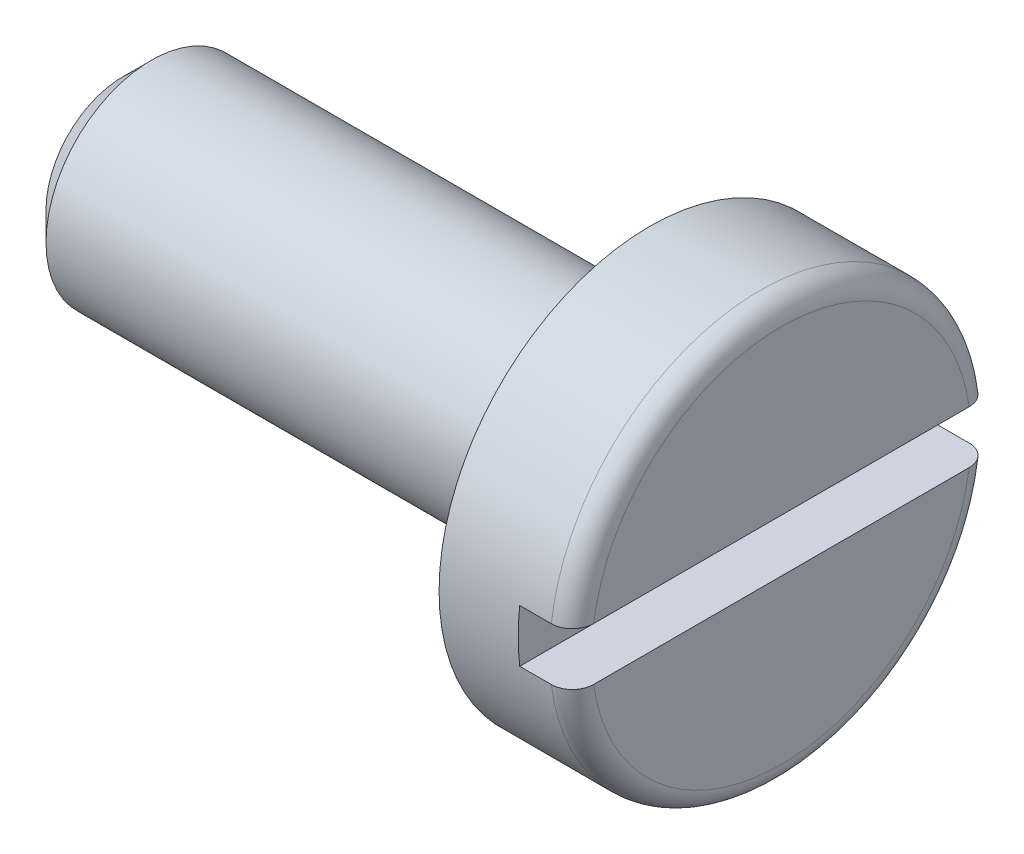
ISO-10303-21;
HEADER;
FILE_DESCRIPTION(('STEP AP214'),'2;1');
FILE_NAME('part.step','',(''),(''),'','','');
FILE_SCHEMA(('AUTOMOTIVE_DESIGN { 1 0 10303 214 1 1 1 1 }'));
ENDSEC;
DATA;
#1=APPLICATION_CONTEXT('core data for automotive mechanical design processes');
#2=APPLICATION_PROTOCOL_DEFINITION('international standard','automotive_design',2000,#1);
#3=PRODUCT_CONTEXT('',#1,'mechanical');
#4=PRODUCT('Part','Part','',(#3));
#5=PRODUCT_RELATED_PRODUCT_CATEGORY('part','',(#4));
#6=PRODUCT_DEFINITION_FORMATION('','',#4);
#7=PRODUCT_DEFINITION_CONTEXT('part definition',#1,'design');
#8=PRODUCT_DEFINITION('design','',#6,#7);
#9=PRODUCT_DEFINITION_SHAPE('','',#8);
#10=(LENGTH_UNIT() NAMED_UNIT(*) SI_UNIT(.MILLI.,.METRE.));
#11=(NAMED_UNIT(*) PLANE_ANGLE_UNIT() SI_UNIT($,.RADIAN.));
#12=(NAMED_UNIT(*) SI_UNIT($,.STERADIAN.) SOLID_ANGLE_UNIT());
#13=UNCERTAINTY_MEASURE_WITH_UNIT(LENGTH_MEASURE(1.E-05),#10,'distance_accuracy_value','');
#14=(GEOMETRIC_REPRESENTATION_CONTEXT(3) GLOBAL_UNCERTAINTY_ASSIGNED_CONTEXT((#13)) GLOBAL_UNIT_ASSIGNED_CONTEXT((#10,
#11,#12)) REPRESENTATION_CONTEXT('',''));
#15=CARTESIAN_POINT('',(0.,0.,0.));
#16=DIRECTION('',(0.,0.,1.));
#17=DIRECTION('',(1.,0.,0.));
#18=AXIS2_PLACEMENT_3D('',#15,#16,#17);
#19=CARTESIAN_POINT('',(0.,0.,0.));
#20=DIRECTION('',(1.,0.,0.));
#21=DIRECTION('',(0.,0.,-1.));
#22=AXIS2_PLACEMENT_3D('',#19,#20,#21);
#23=PLANE('',#22);
#24=CARTESIAN_POINT('',(0.,0.,0.));
#25=DIRECTION('',(1.,0.,0.));
#26=DIRECTION('',(0.,0.,-1.));
#27=AXIS2_PLACEMENT_3D('',#24,#25,#26);
#28=CIRCLE('',#27,1.44);
#29=CARTESIAN_POINT('',(0.,0.199999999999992,-1.42604347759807));
#30=VERTEX_POINT('',#29);
#31=CARTESIAN_POINT('',(0.,0.199999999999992,1.42604347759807));
#32=VERTEX_POINT('',#31);
#33=EDGE_CURVE('E111',#30,#32,#28,.T.);
#34=ORIENTED_EDGE('',*,*,#33,.T.);
#35=DIRECTION('',(0.,0.,-1.));
#36=VECTOR('',#35,1.);
#37=CARTESIAN_POINT('',(0.,0.200000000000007,1.6));
#38=LINE('',#37,#36);
#39=EDGE_CURVE('E189',#32,#30,#38,.T.);
#40=ORIENTED_EDGE('',*,*,#39,.T.);
#41=EDGE_LOOP('',(#34,#40));
#42=FACE_BOUND('',#41,.T.);
#43=ADVANCED_FACE('F37',(#42),#23,.T.);
#44=CARTESIAN_POINT('',(0.,-0.200000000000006,1.42604347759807));
#45=VERTEX_POINT('',#44);
#46=CARTESIAN_POINT('',(0.,-0.200000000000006,-1.42604347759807));
#47=VERTEX_POINT('',#46);
#48=EDGE_CURVE('E107',#45,#47,#28,.T.);
#49=ORIENTED_EDGE('',*,*,#48,.T.);
#50=DIRECTION('',(0.,0.,1.));
#51=VECTOR('',#50,1.);
#52=CARTESIAN_POINT('',(0.,-0.200000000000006,-1.6));
#53=LINE('',#52,#51);
#54=EDGE_CURVE('E190',#47,#45,#53,.T.);
#55=ORIENTED_EDGE('',*,*,#54,.T.);
#56=EDGE_LOOP('',(#49,#55));
#57=FACE_BOUND('',#56,.T.);
#58=ADVANCED_FACE('F181',(#57),#23,.T.);
#59=CARTESIAN_POINT('',(-0.16,0.,0.));
#60=DIRECTION('',(1.,0.,0.));
#61=DIRECTION('',(0.,0.,-1.));
#62=AXIS2_PLACEMENT_3D('',#59,#60,#61);
#63=TOROIDAL_SURFACE('',#62,1.44,0.16);
#64=ORIENTED_EDGE('',*,*,#33,.F.);
#65=CARTESIAN_POINT('',(-0.126413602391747,0.199999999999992,-1.5838576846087));
#66=CARTESIAN_POINT('',(-0.135133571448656,0.199999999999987,-1.58574430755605));
#67=CARTESIAN_POINT('',(-0.144019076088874,0.200000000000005,-1.58689612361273));
#68=CARTESIAN_POINT('',(-0.161864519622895,0.200000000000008,-1.58769147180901));
#69=CARTESIAN_POINT('',(-0.170824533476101,0.199999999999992,-1.58733323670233));
#70=CARTESIAN_POINT('',(-0.188553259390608,0.199999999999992,-1.58511702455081));
#71=CARTESIAN_POINT('',(-0.197322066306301,0.200000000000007,-1.5832598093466));
#72=CARTESIAN_POINT('',(-0.214421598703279,0.200000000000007,-1.57810174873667));
#73=CARTESIAN_POINT('',(-0.222752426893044,0.199999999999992,-1.57480124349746));
#74=CARTESIAN_POINT('',(-0.238755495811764,0.199999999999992,-1.56684813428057));
#75=CARTESIAN_POINT('',(-0.246426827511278,0.200000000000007,-1.56219370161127));
#76=CARTESIAN_POINT('',(-0.260885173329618,0.200000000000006,-1.55166969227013));
#77=CARTESIAN_POINT('',(-0.26767213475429,0.199999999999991,-1.54580004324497));
#78=CARTESIAN_POINT('',(-0.280211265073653,0.199999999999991,-1.53297777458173));
#79=CARTESIAN_POINT('',(-0.28595732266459,0.200000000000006,-1.52601917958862));
#80=CARTESIAN_POINT('',(-0.296210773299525,0.200000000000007,-1.51124265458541));
#81=CARTESIAN_POINT('',(-0.300718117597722,0.199999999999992,-1.50342469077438));
#82=CARTESIAN_POINT('',(-0.30840535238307,0.199999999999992,-1.48708348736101));
#83=CARTESIAN_POINT('',(-0.311574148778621,0.200000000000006,-1.47855502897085));
#84=CARTESIAN_POINT('',(-0.316447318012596,0.200000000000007,-1.46108955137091));
#85=CARTESIAN_POINT('',(-0.318151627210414,0.199999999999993,-1.45215251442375));
#86=CARTESIAN_POINT('',(-0.320059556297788,0.199999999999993,-1.43404950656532));
#87=CARTESIAN_POINT('',(-0.320251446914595,0.200000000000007,-1.42488229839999));
#88=CARTESIAN_POINT('',(-0.319100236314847,0.200000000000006,-1.4066446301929));
#89=CARTESIAN_POINT('',(-0.317757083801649,0.199999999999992,-1.39757417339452));
#90=CARTESIAN_POINT('',(-0.313564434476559,0.199999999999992,-1.3797492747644));
#91=CARTESIAN_POINT('',(-0.310708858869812,0.200000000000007,-1.3709962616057));
#92=CARTESIAN_POINT('',(-0.303565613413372,0.200000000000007,-1.35409523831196));
#93=CARTESIAN_POINT('',(-0.299277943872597,0.199999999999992,-1.34594722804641));
#94=CARTESIAN_POINT('',(-0.28939904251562,0.199999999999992,-1.33050963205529));
#95=CARTESIAN_POINT('',(-0.283810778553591,0.200000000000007,-1.32321814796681));
#96=CARTESIAN_POINT('',(-0.271479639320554,0.200000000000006,-1.30968707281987));
#97=CARTESIAN_POINT('',(-0.264736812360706,0.199999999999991,-1.30344743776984));
#98=CARTESIAN_POINT('',(-0.250349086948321,0.199999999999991,-1.29225698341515));
#99=CARTESIAN_POINT('',(-0.242712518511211,0.200000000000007,-1.28729545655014));
#100=CARTESIAN_POINT('',(-0.226707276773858,0.200000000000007,-1.27874218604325));
#101=CARTESIAN_POINT('',(-0.218338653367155,0.199999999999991,-1.27515034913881));
#102=CARTESIAN_POINT('',(-0.201209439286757,0.199999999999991,-1.26948076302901));
#103=CARTESIAN_POINT('',(-0.192454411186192,0.200000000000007,-1.26738620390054));
#104=CARTESIAN_POINT('',(-0.174716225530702,0.200000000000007,-1.26470987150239));
#105=CARTESIAN_POINT('',(-0.165733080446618,0.199999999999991,-1.26412801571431));
#106=CARTESIAN_POINT('',(-0.14786988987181,0.199999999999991,-1.26449361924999));
#107=CARTESIAN_POINT('',(-0.138989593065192,0.200000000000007,-1.26542893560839));
#108=CARTESIAN_POINT('',(-0.121512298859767,0.200000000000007,-1.26877713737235));
#109=CARTESIAN_POINT('',(-0.112915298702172,0.199999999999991,-1.27119000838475));
#110=CARTESIAN_POINT('',(-0.0962448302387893,0.199999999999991,-1.2774204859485));
#111=CARTESIAN_POINT('',(-0.0881714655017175,0.200000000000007,-1.28123836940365));
#112=CARTESIAN_POINT('',(-0.0727731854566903,0.200000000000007,-1.29016479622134));
#113=CARTESIAN_POINT('',(-0.0654482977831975,0.199999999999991,-1.29527338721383));
#114=CARTESIAN_POINT('',(-0.051689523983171,0.199999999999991,-1.30667881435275));
#115=CARTESIAN_POINT('',(-0.0452633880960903,0.200000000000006,-1.31298499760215));
#116=CARTESIAN_POINT('',(-0.0335464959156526,0.200000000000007,-1.32657602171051));
#117=CARTESIAN_POINT('',(-0.028255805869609,0.199999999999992,-1.33386091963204));
#118=CARTESIAN_POINT('',(-0.0188971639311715,0.199999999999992,-1.34929122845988));
#119=CARTESIAN_POINT('',(-0.0148437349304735,0.200000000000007,-1.35744544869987));
#120=CARTESIAN_POINT('',(-0.00814988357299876,0.200000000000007,-1.37431464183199));
#121=CARTESIAN_POINT('',(-0.00550953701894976,0.199999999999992,-1.38302964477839));
#122=CARTESIAN_POINT('',(-0.00169634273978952,0.199999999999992,-1.40085370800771));
#123=CARTESIAN_POINT('',(-0.000536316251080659,0.200000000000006,-1.40996551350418));
#124=CARTESIAN_POINT('',(0.000241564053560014,0.200000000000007,-1.42825488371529));
#125=CARTESIAN_POINT('',(-0.000140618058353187,0.199999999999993,-1.43743244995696));
#126=CARTESIAN_POINT('',(-0.00244143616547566,0.199999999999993,-1.45561500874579));
#127=CARTESIAN_POINT('',(-0.00436365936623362,0.200000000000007,-1.46461954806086));
#128=CARTESIAN_POINT('',(-0.00969854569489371,0.200000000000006,-1.48217555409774));
#129=CARTESIAN_POINT('',(-0.0131111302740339,0.199999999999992,-1.49072704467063));
#130=CARTESIAN_POINT('',(-0.0213171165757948,0.199999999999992,-1.5070957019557));
#131=CARTESIAN_POINT('',(-0.0261047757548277,0.200000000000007,-1.51491574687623));
#132=CARTESIAN_POINT('',(-0.0369361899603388,0.200000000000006,-1.52963480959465));
#133=CARTESIAN_POINT('',(-0.0429802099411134,0.199999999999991,-1.53653363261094));
#134=CARTESIAN_POINT('',(-0.0561040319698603,0.199999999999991,-1.54915685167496));
#135=CARTESIAN_POINT('',(-0.063175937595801,0.200000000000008,-1.55488946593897));
#136=CARTESIAN_POINT('',(-0.0781831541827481,0.200000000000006,-1.56506835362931));
#137=CARTESIAN_POINT('',(-0.086117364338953,0.199999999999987,-1.56951624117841));
#138=CARTESIAN_POINT('',(-0.0995001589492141,0.199999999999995,-1.57558512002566));
#139=CARTESIAN_POINT('',(-0.10475674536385,0.200000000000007,-1.57763946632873));
#140=CARTESIAN_POINT('',(-0.115458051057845,0.200000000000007,-1.58117959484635));
#141=CARTESIAN_POINT('',(-0.12090276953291,0.199999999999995,-1.58266537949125));
#142=CARTESIAN_POINT('',(-0.126413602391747,0.199999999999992,-1.5838576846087));
#143=B_SPLINE_CURVE_WITH_KNOTS('',3,(#65,#66,#67,#68,#69,#70,#71,#72,#73,#74,#75,#76,#77,#78,
#79,#80,#81,#82,#83,#84,#85,#86,#87,#88,#89,#90,#91,#92,#93,#94,#95,#96,#97,#98,#99,#100,#101,
#102,#103,#104,#105,#106,#107,#108,#109,#110,#111,#112,#113,#114,#115,#116,#117,#118,#119,#120,
#121,#122,#123,#124,#125,#126,#127,#128,#129,#130,#131,#132,#133,#134,#135,#136,#137,#138,#139,
#140,#141,#142),.UNSPECIFIED.,.T.,.F.,(4,2,2,2,2,2,2,2,2,2,2,2,2,2,2,2,2,2,2,2,2,2,2,2,2,2,2,2,
2,2,2,2,2,2,2,2,2,2,4),(0.,0.0267445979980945,0.0535205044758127,0.0802828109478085,
0.107038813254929,0.133831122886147,0.160625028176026,0.187571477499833,0.21451898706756,
0.241685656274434,0.26885350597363,0.29623184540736,0.323611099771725,0.351101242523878,
0.378591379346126,0.406019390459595,0.433446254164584,0.460635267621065,0.487822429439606,
0.514699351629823,0.541574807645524,0.568236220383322,0.594897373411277,0.621563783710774,
0.648231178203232,0.67511596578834,0.702002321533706,0.729193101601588,0.756385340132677,
0.783811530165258,0.811238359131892,0.838729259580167,0.866218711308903,0.893594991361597,
0.920977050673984,0.948158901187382,0.975306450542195,0.99220853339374,1.0091105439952),.UNSPECIFIED.);
#144=CARTESIAN_POINT('',(-0.16,0.199999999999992,-1.58745078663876));
#145=VERTEX_POINT('',#144);
#146=EDGE_CURVE('E139',#30,#145,#143,.T.);
#147=ORIENTED_EDGE('',*,*,#146,.T.);
#148=CARTESIAN_POINT('',(-0.16,0.,0.));
#149=DIRECTION('',(1.,0.,0.));
#150=DIRECTION('',(0.,0.,-1.));
#151=AXIS2_PLACEMENT_3D('',#148,#149,#150);
#152=CIRCLE('',#151,1.6);
#153=CARTESIAN_POINT('',(-0.16,0.200000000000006,1.58745078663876));
#154=VERTEX_POINT('',#153);
#155=EDGE_CURVE('E104',#145,#154,#152,.T.);
#156=ORIENTED_EDGE('',*,*,#155,.T.);
#157=CARTESIAN_POINT('',(-0.124745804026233,0.199999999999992,1.26825944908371));
#158=CARTESIAN_POINT('',(-0.133408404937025,0.199999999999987,1.26627888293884));
#159=CARTESIAN_POINT('',(-0.142244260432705,0.200000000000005,1.26502783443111));
#160=CARTESIAN_POINT('',(-0.160007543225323,0.200000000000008,1.26402775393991));
#161=CARTESIAN_POINT('',(-0.16893506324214,0.199999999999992,1.2642804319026));
#162=CARTESIAN_POINT('',(-0.186616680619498,0.199999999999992,1.26628210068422));
#163=CARTESIAN_POINT('',(-0.195370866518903,0.200000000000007,1.26803030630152));
#164=CARTESIAN_POINT('',(-0.212460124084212,0.200000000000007,1.27296823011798));
#165=CARTESIAN_POINT('',(-0.220795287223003,0.199999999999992,1.27615763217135));
#166=CARTESIAN_POINT('',(-0.236834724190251,0.199999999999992,1.28389043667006));
#167=CARTESIAN_POINT('',(-0.244537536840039,0.200000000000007,1.28843686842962));
#168=CARTESIAN_POINT('',(-0.259080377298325,0.200000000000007,1.29874688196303));
#169=CARTESIAN_POINT('',(-0.265920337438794,0.199999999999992,1.30451055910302));
#170=CARTESIAN_POINT('',(-0.278614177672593,0.199999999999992,1.31714940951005));
#171=CARTESIAN_POINT('',(-0.284457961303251,0.200000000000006,1.32403472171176));
#172=CARTESIAN_POINT('',(-0.294921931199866,0.200000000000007,1.33867952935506));
#173=CARTESIAN_POINT('',(-0.2995420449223,0.199999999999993,1.34643907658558));
#174=CARTESIAN_POINT('',(-0.307480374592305,0.199999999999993,1.36270502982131));
#175=CARTESIAN_POINT('',(-0.310783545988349,0.200000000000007,1.37121877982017));
#176=CARTESIAN_POINT('',(-0.315925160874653,0.200000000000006,1.38867769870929));
#177=CARTESIAN_POINT('',(-0.31776354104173,0.199999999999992,1.39762288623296));
#178=CARTESIAN_POINT('',(-0.319933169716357,0.199999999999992,1.41575887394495));
#179=CARTESIAN_POINT('',(-0.320253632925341,0.200000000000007,1.42495096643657));
#180=CARTESIAN_POINT('',(-0.319347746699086,0.200000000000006,1.44325879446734));
#181=CARTESIAN_POINT('',(-0.318121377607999,0.199999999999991,1.45237452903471));
#182=CARTESIAN_POINT('',(-0.3141522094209,0.199999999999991,1.47027428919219));
#183=CARTESIAN_POINT('',(-0.311408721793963,0.200000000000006,1.47905816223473));
#184=CARTESIAN_POINT('',(-0.30447816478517,0.200000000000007,1.49603684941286));
#185=CARTESIAN_POINT('',(-0.30029112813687,0.199999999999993,1.5042316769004));
#186=CARTESIAN_POINT('',(-0.290614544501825,0.199999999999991,1.51975143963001));
#187=CARTESIAN_POINT('',(-0.28513210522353,0.200000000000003,1.52708080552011));
#188=CARTESIAN_POINT('',(-0.273005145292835,0.200000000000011,1.54070537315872));
#189=CARTESIAN_POINT('',(-0.266360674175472,0.200000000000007,1.54700061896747));
#190=CARTESIAN_POINT('',(-0.252156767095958,0.200000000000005,1.55832289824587));
#191=CARTESIAN_POINT('',(-0.244605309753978,0.200000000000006,1.56335994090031));
#192=CARTESIAN_POINT('',(-0.228758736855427,0.200000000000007,1.57208319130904));
#193=CARTESIAN_POINT('',(-0.220463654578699,0.200000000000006,1.57576945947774));
#194=CARTESIAN_POINT('',(-0.203434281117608,0.200000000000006,1.5816578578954));
#195=CARTESIAN_POINT('',(-0.194703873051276,0.200000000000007,1.58387122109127));
#196=CARTESIAN_POINT('',(-0.176994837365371,0.200000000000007,1.58679328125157));
#197=CARTESIAN_POINT('',(-0.168016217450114,0.200000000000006,1.5875020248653));
#198=CARTESIAN_POINT('',(-0.150109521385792,0.200000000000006,1.58739401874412));
#199=CARTESIAN_POINT('',(-0.141181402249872,0.200000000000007,1.5865842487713));
#200=CARTESIAN_POINT('',(-0.123588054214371,0.200000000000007,1.58347699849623));
#201=CARTESIAN_POINT('',(-0.11492282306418,0.200000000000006,1.58117953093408));
#202=CARTESIAN_POINT('',(-0.0981010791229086,0.200000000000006,1.57516496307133));
#203=CARTESIAN_POINT('',(-0.0899445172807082,0.200000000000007,1.57144799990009));
#204=CARTESIAN_POINT('',(-0.0743675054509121,0.200000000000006,1.56270319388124));
#205=CARTESIAN_POINT('',(-0.0669470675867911,0.200000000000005,1.5576753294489));
#206=CARTESIAN_POINT('',(-0.0530168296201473,0.200000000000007,1.54642946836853));
#207=CARTESIAN_POINT('',(-0.0465111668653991,0.200000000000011,1.54020634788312));
#208=CARTESIAN_POINT('',(-0.034627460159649,0.200000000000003,1.52676349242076));
#209=CARTESIAN_POINT('',(-0.0292494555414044,0.199999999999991,1.51954372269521));
#210=CARTESIAN_POINT('',(-0.0197297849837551,0.199999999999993,1.50425461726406));
#211=CARTESIAN_POINT('',(-0.0155977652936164,0.200000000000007,1.49617927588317));
#212=CARTESIAN_POINT('',(-0.00873543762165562,0.200000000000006,1.47945354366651));
#213=CARTESIAN_POINT('',(-0.00600519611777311,0.199999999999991,1.47080312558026));
#214=CARTESIAN_POINT('',(-0.00200114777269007,0.199999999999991,1.45309640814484));
#215=CARTESIAN_POINT('',(-0.000739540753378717,0.200000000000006,1.44403734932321));
#216=CARTESIAN_POINT('',(0.000254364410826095,0.200000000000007,1.42583563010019));
#217=CARTESIAN_POINT('',(-1.33996646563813E-05,0.199999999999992,1.41669296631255));
#218=CARTESIAN_POINT('',(-0.0020755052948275,0.199999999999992,1.39852812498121));
#219=CARTESIAN_POINT('',(-0.00387858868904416,0.200000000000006,1.38950693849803));
#220=CARTESIAN_POINT('',(-0.00897321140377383,0.200000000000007,1.37189526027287));
#221=CARTESIAN_POINT('',(-0.0122647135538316,0.199999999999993,1.36330475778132));
#222=CARTESIAN_POINT('',(-0.0202465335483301,0.199999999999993,1.34679965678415));
#223=CARTESIAN_POINT('',(-0.0249368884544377,0.200000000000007,1.33888507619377));
#224=CARTESIAN_POINT('',(-0.035589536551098,0.200000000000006,1.32396035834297));
#225=CARTESIAN_POINT('',(-0.0415521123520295,0.199999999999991,1.31695042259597));
#226=CARTESIAN_POINT('',(-0.0545411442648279,0.199999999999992,1.30408588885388));
#227=CARTESIAN_POINT('',(-0.0615608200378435,0.200000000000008,1.29822443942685));
#228=CARTESIAN_POINT('',(-0.0764886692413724,0.200000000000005,1.28778516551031));
#229=CARTESIAN_POINT('',(-0.0843956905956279,0.199999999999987,1.28320570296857));
#230=CARTESIAN_POINT('',(-0.0977650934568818,0.199999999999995,1.27692309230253));
#231=CARTESIAN_POINT('',(-0.103028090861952,0.200000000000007,1.27478599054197));
#232=CARTESIAN_POINT('',(-0.113752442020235,0.200000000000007,1.2710865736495));
#233=CARTESIAN_POINT('',(-0.119213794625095,0.199999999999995,1.26952425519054));
#234=CARTESIAN_POINT('',(-0.124745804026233,0.199999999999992,1.26825944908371));
#235=B_SPLINE_CURVE_WITH_KNOTS('',3,(#157,#158,#159,#160,#161,#162,#163,#164,#165,#166,#167,
#168,#169,#170,#171,#172,#173,#174,#175,#176,#177,#178,#179,#180,#181,#182,#183,#184,#185,#186,
#187,#188,#189,#190,#191,#192,#193,#194,#195,#196,#197,#198,#199,#200,#201,#202,#203,#204,#205,
#206,#207,#208,#209,#210,#211,#212,#213,#214,#215,#216,#217,#218,#219,#220,#221,#222,#223,#224,
#225,#226,#227,#228,#229,#230,#231,#232,#233,#234),.UNSPECIFIED.,.T.,.F.,(4,2,2,2,2,2,2,2,2,2,2,
2,2,2,2,2,2,2,2,2,2,2,2,2,2,2,2,2,2,2,2,2,2,2,2,2,2,2,4),(0.,0.0266376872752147,
0.053305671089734,0.0799596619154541,0.106607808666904,0.133315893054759,0.160026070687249,
0.186992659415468,0.213960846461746,0.241228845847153,0.268498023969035,0.295960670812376,
0.323423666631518,0.350899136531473,0.37837398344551,0.40570144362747,0.433027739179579,
0.460129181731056,0.487229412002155,0.514120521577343,0.541010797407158,0.567777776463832,
0.594544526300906,0.621308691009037,0.648073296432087,0.674955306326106,0.7018382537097,
0.728924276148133,0.756011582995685,0.783322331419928,0.810634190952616,0.838102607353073,
0.865570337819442,0.893038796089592,0.920513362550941,0.947818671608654,0.975088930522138,
0.992100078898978,1.0091111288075),.UNSPECIFIED.);
#236=EDGE_CURVE('E137',#154,#32,#235,.T.);
#237=ORIENTED_EDGE('',*,*,#236,.T.);
#238=EDGE_LOOP('',(#64,#147,#156,#237));
#239=FACE_BOUND('',#238,.T.);
#240=ADVANCED_FACE('F153',(#239),#63,.T.);
#241=CARTESIAN_POINT('',(-0.16,-0.199999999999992,1.58745078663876));
#242=VERTEX_POINT('',#241);
#243=CARTESIAN_POINT('',(-0.16,-0.200000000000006,-1.58745078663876));
#244=VERTEX_POINT('',#243);
#245=EDGE_CURVE('E108',#242,#244,#152,.T.);
#246=ORIENTED_EDGE('',*,*,#245,.T.);
#247=CARTESIAN_POINT('',(-0.126413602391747,-0.200000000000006,-1.5838576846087));
#248=CARTESIAN_POINT('',(-0.117656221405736,-0.200000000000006,-1.58196213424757));
#249=CARTESIAN_POINT('',(-0.109053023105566,-0.200000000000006,-1.57932263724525));
#250=CARTESIAN_POINT('',(-0.0924061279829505,-0.200000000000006,-1.57263168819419));
#251=CARTESIAN_POINT('',(-0.0843631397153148,-0.200000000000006,-1.56857848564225));
#252=CARTESIAN_POINT('',(-0.0690763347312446,-0.200000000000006,-1.55918326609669));
#253=CARTESIAN_POINT('',(-0.0618319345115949,-0.200000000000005,-1.55384219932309));
#254=CARTESIAN_POINT('',(-0.0483393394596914,-0.200000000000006,-1.54202665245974));
#255=CARTESIAN_POINT('',(-0.0420909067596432,-0.200000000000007,-1.53555244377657));
#256=CARTESIAN_POINT('',(-0.0307297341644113,-0.200000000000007,-1.52162046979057));
#257=CARTESIAN_POINT('',(-0.0256228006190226,-0.200000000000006,-1.51415797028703));
#258=CARTESIAN_POINT('',(-0.0167220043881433,-0.200000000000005,-1.49848690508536));
#259=CARTESIAN_POINT('',(-0.0129282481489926,-0.200000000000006,-1.49027827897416));
#260=CARTESIAN_POINT('',(-0.00672850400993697,-0.200000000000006,-1.47327510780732));
#261=CARTESIAN_POINT('',(-0.00433433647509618,-0.200000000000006,-1.46447625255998));
#262=CARTESIAN_POINT('',(-0.00104565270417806,-0.200000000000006,-1.44660260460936));
#263=CARTESIAN_POINT('',(-0.000151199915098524,-0.200000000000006,-1.43752780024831));
#264=CARTESIAN_POINT('',(0.000116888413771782,-0.200000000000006,-1.41929132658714));
#265=CARTESIAN_POINT('',(-0.000520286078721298,-0.200000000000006,-1.41012949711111));
#266=CARTESIAN_POINT('',(-0.00331944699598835,-0.200000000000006,-1.39204164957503));
#267=CARTESIAN_POINT('',(-0.00548146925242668,-0.200000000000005,-1.38311563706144));
#268=CARTESIAN_POINT('',(-0.0112786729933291,-0.200000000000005,-1.36573002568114));
#269=CARTESIAN_POINT('',(-0.0149175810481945,-0.200000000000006,-1.35727166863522));
#270=CARTESIAN_POINT('',(-0.0235693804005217,-0.200000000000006,-1.34108922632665));
#271=CARTESIAN_POINT('',(-0.028582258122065,-0.200000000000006,-1.3333651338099));
#272=CARTESIAN_POINT('',(-0.0398206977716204,-0.200000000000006,-1.31890714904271));
#273=CARTESIAN_POINT('',(-0.0460411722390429,-0.200000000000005,-1.3121693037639));
#274=CARTESIAN_POINT('',(-0.0595351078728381,-0.200000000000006,-1.2998463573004));
#275=CARTESIAN_POINT('',(-0.0668085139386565,-0.200000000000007,-1.29426119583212));
#276=CARTESIAN_POINT('',(-0.082125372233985,-0.200000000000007,-1.28446269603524));
#277=CARTESIAN_POINT('',(-0.0901604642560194,-0.200000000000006,-1.2802362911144));
#278=CARTESIAN_POINT('',(-0.106831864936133,-0.200000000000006,-1.27320992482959));
#279=CARTESIAN_POINT('',(-0.115468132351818,-0.200000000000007,-1.27040986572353));
#280=CARTESIAN_POINT('',(-0.132993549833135,-0.200000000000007,-1.26634635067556));
#281=CARTESIAN_POINT('',(-0.141878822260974,-0.200000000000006,-1.26506616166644));
#282=CARTESIAN_POINT('',(-0.159737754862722,-0.200000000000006,-1.26402579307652));
#283=CARTESIAN_POINT('',(-0.168711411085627,-0.200000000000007,-1.26426554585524));
#284=CARTESIAN_POINT('',(-0.186434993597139,-0.200000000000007,-1.26625137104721));
#285=CARTESIAN_POINT('',(-0.195185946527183,-0.200000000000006,-1.2679883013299));
#286=CARTESIAN_POINT('',(-0.21227317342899,-0.200000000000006,-1.27290302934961));
#287=CARTESIAN_POINT('',(-0.220609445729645,-0.200000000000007,-1.27608083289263));
#288=CARTESIAN_POINT('',(-0.236655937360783,-0.200000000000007,-1.28379170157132));
#289=CARTESIAN_POINT('',(-0.244364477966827,-0.200000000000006,-1.28832825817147));
#290=CARTESIAN_POINT('',(-0.258920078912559,-0.200000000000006,-1.29861947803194));
#291=CARTESIAN_POINT('',(-0.265767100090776,-0.200000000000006,-1.3043741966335));
#292=CARTESIAN_POINT('',(-0.27847649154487,-0.200000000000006,-1.31699632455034));
#293=CARTESIAN_POINT('',(-0.284328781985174,-0.200000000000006,-1.32387388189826));
#294=CARTESIAN_POINT('',(-0.294810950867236,-0.200000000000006,-1.33850470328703));
#295=CARTESIAN_POINT('',(-0.299440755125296,-0.200000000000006,-1.34625802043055));
#296=CARTESIAN_POINT('',(-0.30739951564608,-0.200000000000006,-1.36251317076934));
#297=CARTESIAN_POINT('',(-0.310713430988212,-0.200000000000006,-1.37102236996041));
#298=CARTESIAN_POINT('',(-0.315877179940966,-0.200000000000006,-1.38847403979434));
#299=CARTESIAN_POINT('',(-0.31772694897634,-0.200000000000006,-1.39741652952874));
#300=CARTESIAN_POINT('',(-0.319919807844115,-0.200000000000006,-1.41554923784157));
#301=CARTESIAN_POINT('',(-0.320252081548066,-0.200000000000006,-1.42474076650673));
#302=CARTESIAN_POINT('',(-0.319369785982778,-0.200000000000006,-1.44304947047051));
#303=CARTESIAN_POINT('',(-0.318155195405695,-0.200000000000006,-1.45216664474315));
#304=CARTESIAN_POINT('',(-0.314209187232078,-0.200000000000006,-1.47007147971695));
#305=CARTESIAN_POINT('',(-0.311477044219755,-0.200000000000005,-1.47885898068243));
#306=CARTESIAN_POINT('',(-0.304568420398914,-0.200000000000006,-1.4958468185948));
#307=CARTESIAN_POINT('',(-0.300391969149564,-0.200000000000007,-1.50404716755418));
#308=CARTESIAN_POINT('',(-0.29073527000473,-0.200000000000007,-1.51957995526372));
#309=CARTESIAN_POINT('',(-0.285262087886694,-0.200000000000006,-1.52691678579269));
#310=CARTESIAN_POINT('',(-0.273152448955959,-0.200000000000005,-1.54055745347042));
#311=CARTESIAN_POINT('',(-0.266516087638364,-0.200000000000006,-1.54686137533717));
#312=CARTESIAN_POINT('',(-0.25232755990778,-0.200000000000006,-1.55820164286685));
#313=CARTESIAN_POINT('',(-0.244783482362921,-0.200000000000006,-1.56324810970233));
#314=CARTESIAN_POINT('',(-0.22894778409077,-0.200000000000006,-1.57199255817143));
#315=CARTESIAN_POINT('',(-0.220656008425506,-0.200000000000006,-1.57569025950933));
#316=CARTESIAN_POINT('',(-0.203628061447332,-0.200000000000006,-1.58160316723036));
#317=CARTESIAN_POINT('',(-0.194895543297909,-0.200000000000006,-1.58382891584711));
#318=CARTESIAN_POINT('',(-0.177187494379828,-0.200000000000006,-1.5867719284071));
#319=CARTESIAN_POINT('',(-0.168212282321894,-0.200000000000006,-1.58749108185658));
#320=CARTESIAN_POINT('',(-0.153730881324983,-0.200000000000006,-1.58742310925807));
#321=CARTESIAN_POINT('',(-0.148218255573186,-0.200000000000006,-1.58710896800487));
#322=CARTESIAN_POINT('',(-0.137255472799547,-0.200000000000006,-1.58590977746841));
#323=CARTESIAN_POINT('',(-0.131805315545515,-0.200000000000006,-1.58502473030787));
#324=CARTESIAN_POINT('',(-0.126413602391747,-0.200000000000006,-1.5838576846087));
#325=B_SPLINE_CURVE_WITH_KNOTS('',3,(#247,#248,#249,#250,#251,#252,#253,#254,#255,#256,#257,
#258,#259,#260,#261,#262,#263,#264,#265,#266,#267,#268,#269,#270,#271,#272,#273,#274,#275,#276,
#277,#278,#279,#280,#281,#282,#283,#284,#285,#286,#287,#288,#289,#290,#291,#292,#293,#294,#295,
#296,#297,#298,#299,#300,#301,#302,#303,#304,#305,#306,#307,#308,#309,#310,#311,#312,#313,#314,
#315,#316,#317,#318,#319,#320,#321,#322,#323,#324),.UNSPECIFIED.,.T.,.F.,(4,2,2,2,2,2,2,2,2,2,2,
2,2,2,2,2,2,2,2,2,2,2,2,2,2,2,2,2,2,2,2,2,2,2,2,2,2,2,4),(0.,0.0268602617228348,
0.0537539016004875,0.0806277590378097,0.10749518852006,0.134496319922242,0.161499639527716,
0.188727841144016,0.215957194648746,0.243379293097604,0.270802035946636,0.298294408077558,
0.325786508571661,0.353165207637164,0.380542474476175,0.407647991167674,0.434751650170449,
0.461554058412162,0.488355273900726,0.514993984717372,0.541632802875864,0.568340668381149,
0.595049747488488,0.62201514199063,0.648982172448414,0.676249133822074,0.70351729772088,
0.730979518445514,0.758442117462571,0.785917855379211,0.813393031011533,0.840721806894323,
0.86804834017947,0.895147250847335,0.922251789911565,0.949160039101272,0.976034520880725,
0.99257181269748,1.0091090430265),.UNSPECIFIED.);
#326=EDGE_CURVE('E99',#244,#47,#325,.T.);
#327=ORIENTED_EDGE('',*,*,#326,.T.);
#328=ORIENTED_EDGE('',*,*,#48,.F.);
#329=CARTESIAN_POINT('',(-0.124745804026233,-0.200000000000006,1.26825944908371));
#330=CARTESIAN_POINT('',(-0.116013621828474,-0.200000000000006,1.27025677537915));
#331=CARTESIAN_POINT('',(-0.107444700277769,-0.200000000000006,1.27299838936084));
#332=CARTESIAN_POINT('',(-0.0908839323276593,-0.200000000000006,1.27988819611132));
#333=CARTESIAN_POINT('',(-0.0828928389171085,-0.200000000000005,1.28403818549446));
#334=CARTESIAN_POINT('',(-0.0677258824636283,-0.200000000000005,1.29361462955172));
#335=CARTESIAN_POINT('',(-0.0605492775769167,-0.200000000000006,1.29903990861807));
#336=CARTESIAN_POINT('',(-0.0472017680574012,-0.200000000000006,1.31100780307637));
#337=CARTESIAN_POINT('',(-0.0410306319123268,-0.200000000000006,1.31755016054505));
#338=CARTESIAN_POINT('',(-0.0298115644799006,-0.200000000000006,1.33162252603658));
#339=CARTESIAN_POINT('',(-0.0247730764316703,-0.200000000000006,1.33916006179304));
#340=CARTESIAN_POINT('',(-0.0160177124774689,-0.200000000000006,1.35496752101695));
#341=CARTESIAN_POINT('',(-0.0123009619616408,-0.200000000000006,1.36323751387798));
#342=CARTESIAN_POINT('',(-0.00625713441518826,-0.200000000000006,1.38036626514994));
#343=CARTESIAN_POINT('',(-0.00394469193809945,-0.200000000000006,1.38923018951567));
#344=CARTESIAN_POINT('',(-0.000832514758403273,-0.200000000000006,1.40721984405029));
#345=CARTESIAN_POINT('',(-3.28313500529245E-05,-0.200000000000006,1.41634558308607));
#346=CARTESIAN_POINT('',(3.10013738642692E-05,-0.200000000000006,1.43464766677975));
#347=CARTESIAN_POINT('',(-0.000712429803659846,-0.200000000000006,1.4438240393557));
#348=CARTESIAN_POINT('',(-0.00373199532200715,-0.200000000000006,1.46192121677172));
#349=CARTESIAN_POINT('',(-0.00600812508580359,-0.200000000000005,1.4708420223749));
#350=CARTESIAN_POINT('',(-0.0120273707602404,-0.200000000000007,1.48815661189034));
#351=CARTESIAN_POINT('',(-0.0157678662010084,-0.20000000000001,1.49655130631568));
#352=CARTESIAN_POINT('',(-0.0246143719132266,-0.200000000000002,1.51258761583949));
#353=CARTESIAN_POINT('',(-0.0297203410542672,-0.199999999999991,1.52022925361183));
#354=CARTESIAN_POINT('',(-0.0411171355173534,-0.199999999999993,1.53448656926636));
#355=CARTESIAN_POINT('',(-0.0473997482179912,-0.200000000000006,1.54110881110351));
#356=CARTESIAN_POINT('',(-0.0609959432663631,-0.200000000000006,1.55319353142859));
#357=CARTESIAN_POINT('',(-0.068309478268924,-0.199999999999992,1.5586560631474));
#358=CARTESIAN_POINT('',(-0.0836937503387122,-0.199999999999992,1.56821781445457));
#359=CARTESIAN_POINT('',(-0.0917576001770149,-0.200000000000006,1.57232811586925));
#360=CARTESIAN_POINT('',(-0.108464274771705,-0.200000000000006,1.57912579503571));
#361=CARTESIAN_POINT('',(-0.117107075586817,-0.199999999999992,1.58181323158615));
#362=CARTESIAN_POINT('',(-0.134662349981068,-0.199999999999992,1.58567134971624));
#363=CARTESIAN_POINT('',(-0.143572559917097,-0.200000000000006,1.58685233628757));
#364=CARTESIAN_POINT('',(-0.161464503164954,-0.200000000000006,1.58769645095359));
#365=CARTESIAN_POINT('',(-0.170446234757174,-0.199999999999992,1.58735961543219));
#366=CARTESIAN_POINT('',(-0.188196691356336,-0.199999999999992,1.5851816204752));
#367=CARTESIAN_POINT('',(-0.196965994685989,-0.200000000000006,1.58334516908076));
#368=CARTESIAN_POINT('',(-0.214072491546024,-0.200000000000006,1.57822821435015));
#369=CARTESIAN_POINT('',(-0.222409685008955,-0.199999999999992,1.57494771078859));
#370=CARTESIAN_POINT('',(-0.238430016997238,-0.199999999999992,1.56703281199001));
#371=CARTESIAN_POINT('',(-0.246112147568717,-0.200000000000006,1.56239637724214));
#372=CARTESIAN_POINT('',(-0.260594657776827,-0.200000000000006,1.55190645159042));
#373=CARTESIAN_POINT('',(-0.267395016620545,-0.199999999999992,1.54605293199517));
#374=CARTESIAN_POINT('',(-0.279963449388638,-0.19999999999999,1.53326058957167));
#375=CARTESIAN_POINT('',(-0.285725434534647,-0.200000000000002,1.52631578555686));
#376=CARTESIAN_POINT('',(-0.296012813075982,-0.20000000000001,1.51156397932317));
#377=CARTESIAN_POINT('',(-0.300538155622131,-0.200000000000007,1.50375694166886));
#378=CARTESIAN_POINT('',(-0.308263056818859,-0.200000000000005,1.48743460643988));
#379=CARTESIAN_POINT('',(-0.311451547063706,-0.200000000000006,1.47891407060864));
#380=CARTESIAN_POINT('',(-0.31636517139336,-0.200000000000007,1.46146104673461));
#381=CARTESIAN_POINT('',(-0.318090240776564,-0.200000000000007,1.45252854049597));
#382=CARTESIAN_POINT('',(-0.320040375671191,-0.200000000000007,1.43443098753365));
#383=CARTESIAN_POINT('',(-0.320253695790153,-0.200000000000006,1.4252646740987));
#384=CARTESIAN_POINT('',(-0.319145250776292,-0.200000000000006,1.40702518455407));
#385=CARTESIAN_POINT('',(-0.317823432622,-0.200000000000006,1.39795201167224));
#386=CARTESIAN_POINT('',(-0.313672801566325,-0.200000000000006,1.38011779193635));
#387=CARTESIAN_POINT('',(-0.310837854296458,-0.200000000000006,1.37135817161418));
#388=CARTESIAN_POINT('',(-0.303734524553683,-0.200000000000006,1.35444050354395));
#389=CARTESIAN_POINT('',(-0.299466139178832,-0.200000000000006,1.3462824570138));
#390=CARTESIAN_POINT('',(-0.289623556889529,-0.200000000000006,1.33082111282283));
#391=CARTESIAN_POINT('',(-0.284052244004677,-0.200000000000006,1.32351598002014));
#392=CARTESIAN_POINT('',(-0.271752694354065,-0.200000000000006,1.30995517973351));
#393=CARTESIAN_POINT('',(-0.265024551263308,-0.200000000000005,1.30369942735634));
#394=CARTESIAN_POINT('',(-0.250663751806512,-0.200000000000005,1.29247492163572));
#395=CARTESIAN_POINT('',(-0.243039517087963,-0.200000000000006,1.28749539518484));
#396=CARTESIAN_POINT('',(-0.227053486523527,-0.200000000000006,1.27890305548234));
#397=CARTESIAN_POINT('',(-0.218691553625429,-0.200000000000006,1.27529049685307));
#398=CARTESIAN_POINT('',(-0.201568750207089,-0.200000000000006,1.26957754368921));
#399=CARTESIAN_POINT('',(-0.192813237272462,-0.200000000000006,1.2674610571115));
#400=CARTESIAN_POINT('',(-0.175077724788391,-0.200000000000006,1.26474455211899));
#401=CARTESIAN_POINT('',(-0.166098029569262,-0.200000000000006,1.26414257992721));
#402=CARTESIAN_POINT('',(-0.151689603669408,-0.200000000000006,1.26440274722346));
#403=CARTESIAN_POINT('',(-0.146247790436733,-0.200000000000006,1.26478372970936));
#404=CARTESIAN_POINT('',(-0.135432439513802,-0.200000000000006,1.26610444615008));
#405=CARTESIAN_POINT('',(-0.130058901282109,-0.200000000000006,1.26704417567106));
#406=CARTESIAN_POINT('',(-0.124745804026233,-0.200000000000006,1.26825944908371));
#407=B_SPLINE_CURVE_WITH_KNOTS('',3,(#329,#330,#331,#332,#333,#334,#335,#336,#337,#338,#339,
#340,#341,#342,#343,#344,#345,#346,#347,#348,#349,#350,#351,#352,#353,#354,#355,#356,#357,#358,
#359,#360,#361,#362,#363,#364,#365,#366,#367,#368,#369,#370,#371,#372,#373,#374,#375,#376,#377,
#378,#379,#380,#381,#382,#383,#384,#385,#386,#387,#388,#389,#390,#391,#392,#393,#394,#395,#396,
#397,#398,#399,#400,#401,#402,#403,#404,#405,#406),.UNSPECIFIED.,.T.,.F.,(4,2,2,2,2,2,2,2,2,2,2,
2,2,2,2,2,2,2,2,2,2,2,2,2,2,2,2,2,2,2,2,2,2,2,2,2,2,2,4),(0.,0.0268529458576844,
0.053740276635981,0.0806029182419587,0.107459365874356,0.134532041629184,0.161607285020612,
0.18896004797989,0.216313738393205,0.243802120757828,0.271290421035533,0.298729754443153,
0.32616826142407,0.35342194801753,0.380674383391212,0.407697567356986,0.434719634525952,
0.461555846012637,0.488391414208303,0.515143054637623,0.541894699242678,0.568686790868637,
0.595479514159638,0.62242456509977,0.649370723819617,0.6765357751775,0.703702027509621,
0.731079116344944,0.758457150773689,0.785947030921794,0.813436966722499,0.840866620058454,
0.868294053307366,0.895481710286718,0.922674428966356,0.949570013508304,0.976430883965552,
0.992769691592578,1.00910836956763),.UNSPECIFIED.);
#408=EDGE_CURVE('E135',#45,#242,#407,.T.);
#409=ORIENTED_EDGE('',*,*,#408,.T.);
#410=EDGE_LOOP('',(#246,#327,#328,#409));
#411=FACE_BOUND('',#410,.T.);
#412=ADVANCED_FACE('F133',(#411),#63,.T.);
#413=CARTESIAN_POINT('',(0.,0.,0.));
#414=DIRECTION('',(1.,0.,0.));
#415=DIRECTION('',(0.,0.,-1.));
#416=AXIS2_PLACEMENT_3D('',#413,#414,#415);
#417=CYLINDRICAL_SURFACE('',#416,1.6);
#418=CARTESIAN_POINT('',(-1.,0.,0.));
#419=DIRECTION('',(1.,0.,0.));
#420=DIRECTION('',(0.,0.,-1.));
#421=AXIS2_PLACEMENT_3D('',#418,#419,#420);
#422=CIRCLE('',#421,1.6);
#423=CARTESIAN_POINT('',(-1.,0.,-1.6));
#424=VERTEX_POINT('',#423);
#425=EDGE_CURVE('E114',#424,#424,#422,.T.);
#426=ORIENTED_EDGE('',*,*,#425,.T.);
#427=EDGE_LOOP('',(#426));
#428=FACE_BOUND('',#427,.T.);
#429=ORIENTED_EDGE('',*,*,#155,.F.);
#430=DIRECTION('',(1.,0.,0.));
#431=VECTOR('',#430,1.);
#432=CARTESIAN_POINT('',(0.,0.199999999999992,-1.58745078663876));
#433=LINE('',#432,#431);
#434=CARTESIAN_POINT('',(-0.4,0.199999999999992,-1.58745078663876));
#435=VERTEX_POINT('',#434);
#436=EDGE_CURVE('E11',#145,#435,#433,.F.);
#437=ORIENTED_EDGE('',*,*,#436,.T.);
#438=CARTESIAN_POINT('',(-0.4,0.,0.));
#439=DIRECTION('',(-1.,0.,0.));
#440=DIRECTION('',(0.,0.,1.));
#441=AXIS2_PLACEMENT_3D('',#438,#439,#440);
#442=CIRCLE('',#441,1.6);
#443=CARTESIAN_POINT('',(-0.4,-0.200000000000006,-1.58745078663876));
#444=VERTEX_POINT('',#443);
#445=EDGE_CURVE('E86',#444,#435,#442,.F.);
#446=ORIENTED_EDGE('',*,*,#445,.F.);
#447=DIRECTION('',(1.,0.,0.));
#448=VECTOR('',#447,1.);
#449=CARTESIAN_POINT('',(0.,-0.200000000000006,-1.58745078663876));
#450=LINE('',#449,#448);
#451=EDGE_CURVE('E45',#444,#244,#450,.T.);
#452=ORIENTED_EDGE('',*,*,#451,.T.);
#453=ORIENTED_EDGE('',*,*,#245,.F.);
#454=DIRECTION('',(1.,0.,0.));
#455=VECTOR('',#454,1.);
#456=CARTESIAN_POINT('',(0.,-0.199999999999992,1.58745078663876));
#457=LINE('',#456,#455);
#458=CARTESIAN_POINT('',(-0.4,-0.199999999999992,1.58745078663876));
#459=VERTEX_POINT('',#458);
#460=EDGE_CURVE('E125',#242,#459,#457,.F.);
#461=ORIENTED_EDGE('',*,*,#460,.T.);
#462=CARTESIAN_POINT('',(-0.4,0.200000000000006,1.58745078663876));
#463=VERTEX_POINT('',#462);
#464=EDGE_CURVE('E95',#463,#459,#442,.F.);
#465=ORIENTED_EDGE('',*,*,#464,.F.);
#466=DIRECTION('',(1.,0.,0.));
#467=VECTOR('',#466,1.);
#468=CARTESIAN_POINT('',(0.,0.200000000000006,1.58745078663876));
#469=LINE('',#468,#467);
#470=EDGE_CURVE('E93',#463,#154,#469,.T.);
#471=ORIENTED_EDGE('',*,*,#470,.T.);
#472=EDGE_LOOP('',(#429,#437,#446,#452,#453,#461,#465,#471));
#473=FACE_BOUND('',#472,.T.);
#474=ADVANCED_FACE('F102',(#428,#473),#417,.T.);
#475=CARTESIAN_POINT('',(-1.,1.6,0.));
#476=DIRECTION('',(-1.,0.,0.));
#477=DIRECTION('',(0.,0.,1.));
#478=AXIS2_PLACEMENT_3D('',#475,#476,#477);
#479=PLANE('',#478);
#480=CARTESIAN_POINT('',(-1.,0.,0.));
#481=DIRECTION('',(1.,0.,0.));
#482=DIRECTION('',(0.,0.,-1.));
#483=AXIS2_PLACEMENT_3D('',#480,#481,#482);
#484=CIRCLE('',#483,0.8);
#485=CARTESIAN_POINT('',(-1.,0.,-0.8));
#486=VERTEX_POINT('',#485);
#487=EDGE_CURVE('E193',#486,#486,#484,.T.);
#488=ORIENTED_EDGE('',*,*,#487,.T.);
#489=EDGE_LOOP('',(#488));
#490=FACE_BOUND('',#489,.T.);
#491=ORIENTED_EDGE('',*,*,#425,.F.);
#492=EDGE_LOOP('',(#491));
#493=FACE_BOUND('',#492,.T.);
#494=ADVANCED_FACE('F170',(#490,#493),#479,.T.);
#495=CARTESIAN_POINT('',(0.,0.,0.));
#496=DIRECTION('',(1.,0.,0.));
#497=DIRECTION('',(0.,0.,-1.));
#498=AXIS2_PLACEMENT_3D('',#495,#496,#497);
#499=CYLINDRICAL_SURFACE('',#498,0.8);
#500=CARTESIAN_POINT('',(-4.78531,0.,0.));
#501=DIRECTION('',(-1.,0.,0.));
#502=DIRECTION('',(0.,0.,1.));
#503=AXIS2_PLACEMENT_3D('',#500,#501,#502);
#504=CIRCLE('',#503,0.8);
#505=CARTESIAN_POINT('',(-4.78531,0.,0.8));
#506=VERTEX_POINT('',#505);
#507=EDGE_CURVE('E119',#506,#506,#504,.F.);
#508=ORIENTED_EDGE('',*,*,#507,.T.);
#509=EDGE_LOOP('',(#508));
#510=FACE_BOUND('',#509,.T.);
#511=ORIENTED_EDGE('',*,*,#487,.F.);
#512=EDGE_LOOP('',(#511));
#513=FACE_BOUND('',#512,.T.);
#514=ADVANCED_FACE('F166',(#510,#513),#499,.T.);
#515=CARTESIAN_POINT('',(-5.,0.799999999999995,0.));
#516=DIRECTION('',(-1.,0.,0.));
#517=DIRECTION('',(0.,0.,1.));
#518=AXIS2_PLACEMENT_3D('',#515,#516,#517);
#519=PLANE('',#518);
#520=CARTESIAN_POINT('',(-5.,0.,0.));
#521=DIRECTION('',(-1.,0.,0.));
#522=DIRECTION('',(0.,0.,1.));
#523=AXIS2_PLACEMENT_3D('',#520,#521,#522);
#524=CIRCLE('',#523,0.585309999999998);
#525=CARTESIAN_POINT('',(-5.,0.,0.585309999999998));
#526=VERTEX_POINT('',#525);
#527=EDGE_CURVE('E122',#526,#526,#524,.T.);
#528=ORIENTED_EDGE('',*,*,#527,.T.);
#529=EDGE_LOOP('',(#528));
#530=FACE_BOUND('',#529,.T.);
#531=ADVANCED_FACE('F162',(#530),#519,.T.);
#532=CARTESIAN_POINT('',(-4.78531,0.,0.));
#533=DIRECTION('',(1.,0.,0.));
#534=DIRECTION('',(0.,0.,-1.));
#535=AXIS2_PLACEMENT_3D('',#532,#533,#534);
#536=CONICAL_SURFACE('',#535,0.8,0.785398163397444);
#537=ORIENTED_EDGE('',*,*,#527,.F.);
#538=EDGE_LOOP('',(#537));
#539=FACE_BOUND('',#538,.T.);
#540=ORIENTED_EDGE('',*,*,#507,.F.);
#541=EDGE_LOOP('',(#540));
#542=FACE_BOUND('',#541,.T.);
#543=ADVANCED_FACE('F39',(#539,#542),#536,.T.);
#544=CARTESIAN_POINT('',(-0.4,0.200000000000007,1.6));
#545=DIRECTION('',(0.,-1.,0.));
#546=DIRECTION('',(0.,0.,-1.));
#547=AXIS2_PLACEMENT_3D('',#544,#545,#546);
#548=PLANE('',#547);
#549=ORIENTED_EDGE('',*,*,#39,.F.);
#550=ORIENTED_EDGE('',*,*,#236,.F.);
#551=ORIENTED_EDGE('',*,*,#470,.F.);
#552=DIRECTION('',(0.,0.,-1.));
#553=VECTOR('',#552,1.);
#554=CARTESIAN_POINT('',(-0.4,0.200000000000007,1.6));
#555=LINE('',#554,#553);
#556=EDGE_CURVE('E52',#463,#435,#555,.T.);
#557=ORIENTED_EDGE('',*,*,#556,.T.);
#558=ORIENTED_EDGE('',*,*,#436,.F.);
#559=ORIENTED_EDGE('',*,*,#146,.F.);
#560=EDGE_LOOP('',(#549,#550,#551,#557,#558,#559));
#561=FACE_BOUND('',#560,.T.);
#562=ADVANCED_FACE('F96',(#561),#548,.T.);
#563=CARTESIAN_POINT('',(-0.4,-0.200000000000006,-1.6));
#564=DIRECTION('',(0.,1.,0.));
#565=DIRECTION('',(0.,0.,1.));
#566=AXIS2_PLACEMENT_3D('',#563,#564,#565);
#567=PLANE('',#566);
#568=ORIENTED_EDGE('',*,*,#54,.F.);
#569=ORIENTED_EDGE('',*,*,#326,.F.);
#570=ORIENTED_EDGE('',*,*,#451,.F.);
#571=DIRECTION('',(0.,0.,1.));
#572=VECTOR('',#571,1.);
#573=CARTESIAN_POINT('',(-0.4,-0.200000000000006,-1.6));
#574=LINE('',#573,#572);
#575=EDGE_CURVE('E89',#444,#459,#574,.T.);
#576=ORIENTED_EDGE('',*,*,#575,.T.);
#577=ORIENTED_EDGE('',*,*,#460,.F.);
#578=ORIENTED_EDGE('',*,*,#408,.F.);
#579=EDGE_LOOP('',(#568,#569,#570,#576,#577,#578));
#580=FACE_BOUND('',#579,.T.);
#581=ADVANCED_FACE('F156',(#580),#567,.T.);
#582=CARTESIAN_POINT('',(-0.4,-0.199999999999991,1.6));
#583=DIRECTION('',(-1.,0.,0.));
#584=DIRECTION('',(0.,0.,1.));
#585=AXIS2_PLACEMENT_3D('',#582,#583,#584);
#586=PLANE('',#585);
#587=ORIENTED_EDGE('',*,*,#575,.F.);
#588=ORIENTED_EDGE('',*,*,#445,.T.);
#589=ORIENTED_EDGE('',*,*,#556,.F.);
#590=ORIENTED_EDGE('',*,*,#464,.T.);
#591=EDGE_LOOP('',(#587,#588,#589,#590));
#592=FACE_BOUND('',#591,.T.);
#593=ADVANCED_FACE('F87',(#592),#586,.F.);
#594=CLOSED_SHELL('',(#43,#58,#240,#412,#474,#494,#514,#531,#543,#562,#581,#593));
#595=MANIFOLD_SOLID_BREP('B2',#594);
#596=ADVANCED_BREP_SHAPE_REPRESENTATION('',(#18,#595),#14);
#597=SHAPE_DEFINITION_REPRESENTATION(#9,#596);
ENDSEC;
END-ISO-10303-21;
